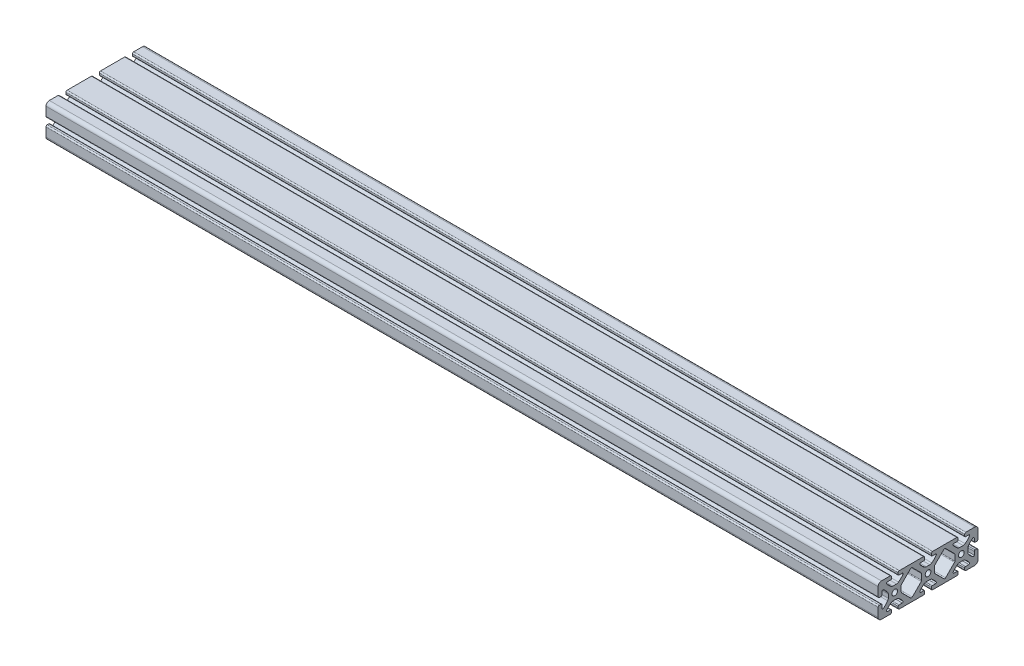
from build123d import *

# Parameters (mm, degrees)
MODEL_R                = 3.4
STRUKTURBAUTEIL1_DEPTH = 1000


with BuildPart() as part:
    # Model → Strukturbauteil1 (new body)
    with BuildSketch(Plane(origin=(0, 0, 0), x_dir=(0, 0, -1), z_dir=(1, 0, 0))):
        with BuildLine():
            Line((-60, 16), (-60, 5.5))
            ThreePointArc((-60, 5.5), (-59.560660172, 4.439339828), (-58.5, 4))
            Line((-58.5, 4), (-56.5, 4))
            ThreePointArc((-56.5, 4), (-55.792893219, 4.292893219), (-55.5, 5))
            Line((-55.5, 5), (-55.5, 8.963997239))
            ThreePointArc((-55.5, 8.963997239), (-54.931938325, 9.888298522), (-53.850713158, 9.798972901))
            ThreePointArc((-53.850713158, 9.798972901), (-50.99018775, 7.345508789), (-48.530952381, 4.489943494))
            ThreePointArc((-48.530952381, 4.489943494), (-47.950250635, 3.365314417), (-47.75, 2.115552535))
            Line((-47.75, 2.115552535), (-47.75, -2.115552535))
            ThreePointArc((-47.75, -2.115552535), (-47.950250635, -3.365314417), (-48.530952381, -4.489943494))
            ThreePointArc((-48.530952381, -4.489943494), (-50.99018775, -7.345508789), (-53.850713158, -9.798972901))
            ThreePointArc((-53.850713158, -9.798972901), (-54.931938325, -9.888298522), (-55.5, -8.963997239))
            Line((-55.5, -8.963997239), (-55.5, -5))
            ThreePointArc((-55.5, -5), (-55.792893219, -4.292893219), (-56.5, -4))
            Line((-56.5, -4), (-58.5, -4))
            ThreePointArc((-58.5, -4), (-59.560660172, -4.439339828), (-60, -5.5))
            Line((-60, -5.5), (-60, -16))
            ThreePointArc((-60, -16), (-58.828427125, -18.828427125), (-56, -20))
            Line((-56, -20), (-45.5, -20))
            ThreePointArc((-45.5, -20), (-44.439339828, -19.560660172), (-44, -18.5))
            Line((-44, -18.5), (-44, -16.5))
            ThreePointArc((-44, -16.5), (-44.292893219, -15.792893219), (-45, -15.5))
            Line((-45, -15.5), (-48.963997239, -15.5))
            ThreePointArc((-48.963997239, -15.5), (-49.888298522, -14.931938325), (-49.798972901, -13.850713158))
            ThreePointArc((-49.798972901, -13.850713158), (-47.345508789, -10.99018775), (-44.489943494, -8.530952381))
            ThreePointArc((-44.489943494, -8.530952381), (-43.365314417, -7.950250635), (-42.115552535, -7.75))
            Line((-42.115552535, -7.75), (-37.884447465, -7.75))
            ThreePointArc((-37.884447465, -7.75), (-36.634685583, -7.950250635), (-35.510056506, -8.530952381))
            ThreePointArc((-35.510056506, -8.530952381), (-32.654491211, -10.99018775), (-30.201027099, -13.850713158))
            ThreePointArc((-30.201027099, -13.850713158), (-30.111701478, -14.931938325), (-31.036002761, -15.5))
            Line((-31.036002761, -15.5), (-35, -15.5))
            ThreePointArc((-35, -15.5), (-35.707106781, -15.792893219), (-36, -16.5))
            Line((-36, -16.5), (-36, -18.5))
            ThreePointArc((-36, -18.5), (-35.560660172, -19.560660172), (-34.5, -20))
            Line((-34.5, -20), (-5.5, -20))
            ThreePointArc((-5.5, -20), (-4.439339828, -19.560660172), (-4, -18.5))
            Line((-4, -18.5), (-4, -16.5))
            ThreePointArc((-4, -16.5), (-4.292893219, -15.792893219), (-5, -15.5))
            Line((-5, -15.5), (-8.963997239, -15.5))
            ThreePointArc((-8.963997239, -15.5), (-9.888298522, -14.931938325), (-9.798972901, -13.850713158))
            ThreePointArc((-9.798972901, -13.850713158), (-7.345508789, -10.99018775), (-4.489943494, -8.530952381))
            ThreePointArc((-4.489943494, -8.530952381), (-3.365314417, -7.950250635), (-2.115552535, -7.75))
            Line((-2.115552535, -7.75), (2.115552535, -7.75))
            ThreePointArc((2.115552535, -7.75), (3.365314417, -7.950250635), (4.489943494, -8.530952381))
            ThreePointArc((4.489943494, -8.530952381), (7.345508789, -10.99018775), (9.798972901, -13.850713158))
            ThreePointArc((9.798972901, -13.850713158), (9.888298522, -14.931938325), (8.963997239, -15.5))
            Line((8.963997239, -15.5), (5, -15.5))
            ThreePointArc((5, -15.5), (4.292893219, -15.792893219), (4, -16.5))
            Line((4, -16.5), (4, -18.5))
            ThreePointArc((4, -18.5), (4.439339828, -19.560660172), (5.5, -20))
            Line((5.5, -20), (34.5, -20))
            ThreePointArc((34.5, -20), (35.560660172, -19.560660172), (36, -18.5))
            Line((36, -18.5), (36, -16.5))
            ThreePointArc((36, -16.5), (35.707106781, -15.792893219), (35, -15.5))
            Line((35, -15.5), (31.036002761, -15.5))
            ThreePointArc((31.036002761, -15.5), (30.111701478, -14.931938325), (30.201027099, -13.850713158))
            ThreePointArc((30.201027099, -13.850713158), (32.654491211, -10.99018775), (35.510056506, -8.530952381))
            ThreePointArc((35.510056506, -8.530952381), (36.634685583, -7.950250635), (37.884447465, -7.75))
            Line((37.884447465, -7.75), (42.115552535, -7.75))
            ThreePointArc((42.115552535, -7.75), (43.365314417, -7.950250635), (44.489943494, -8.530952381))
            ThreePointArc((44.489943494, -8.530952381), (47.345508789, -10.99018775), (49.798972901, -13.850713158))
            ThreePointArc((49.798972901, -13.850713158), (49.888298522, -14.931938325), (48.963997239, -15.5))
            Line((48.963997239, -15.5), (45, -15.5))
            ThreePointArc((45, -15.5), (44.292893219, -15.792893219), (44, -16.5))
            Line((44, -16.5), (44, -18.5))
            ThreePointArc((44, -18.5), (44.439339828, -19.560660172), (45.5, -20))
            Line((45.5, -20), (56, -20))
            ThreePointArc((56, -20), (58.828427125, -18.828427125), (60, -16))
            Line((60, -16), (60, -5.5))
            ThreePointArc((60, -5.5), (59.560660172, -4.439339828), (58.5, -4))
            Line((58.5, -4), (56.5, -4))
            ThreePointArc((56.5, -4), (55.792893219, -4.292893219), (55.5, -5))
            Line((55.5, -5), (55.5, -8.963997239))
            ThreePointArc((55.5, -8.963997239), (54.931938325, -9.888298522), (53.850713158, -9.798972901))
            ThreePointArc((53.850713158, -9.798972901), (50.99018775, -7.345508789), (48.530952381, -4.489943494))
            ThreePointArc((48.530952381, -4.489943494), (47.950250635, -3.365314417), (47.75, -2.115552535))
            Line((47.75, -2.115552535), (47.75, 2.115552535))
            ThreePointArc((47.75, 2.115552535), (47.950250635, 3.365314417), (48.530952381, 4.489943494))
            ThreePointArc((48.530952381, 4.489943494), (50.99018775, 7.345508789), (53.850713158, 9.798972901))
            ThreePointArc((53.850713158, 9.798972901), (54.931938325, 9.888298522), (55.5, 8.963997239))
            Line((55.5, 8.963997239), (55.5, 5))
            ThreePointArc((55.5, 5), (55.792893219, 4.292893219), (56.5, 4))
            Line((56.5, 4), (58.5, 4))
            ThreePointArc((58.5, 4), (59.560660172, 4.439339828), (60, 5.5))
            Line((60, 5.5), (60, 16))
            ThreePointArc((60, 16), (58.828427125, 18.828427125), (56, 20))
            Line((56, 20), (45.5, 20))
            ThreePointArc((45.5, 20), (44.439339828, 19.560660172), (44, 18.5))
            Line((44, 18.5), (44, 16.5))
            ThreePointArc((44, 16.5), (44.292893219, 15.792893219), (45, 15.5))
            Line((45, 15.5), (48.963997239, 15.5))
            ThreePointArc((48.963997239, 15.5), (49.888298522, 14.931938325), (49.798972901, 13.850713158))
            ThreePointArc((49.798972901, 13.850713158), (47.345508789, 10.99018775), (44.489943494, 8.530952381))
            ThreePointArc((44.489943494, 8.530952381), (43.365314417, 7.950250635), (42.115552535, 7.75))
            Line((42.115552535, 7.75), (37.884447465, 7.75))
            ThreePointArc((37.884447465, 7.75), (36.634685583, 7.950250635), (35.510056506, 8.530952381))
            ThreePointArc((35.510056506, 8.530952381), (32.654491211, 10.99018775), (30.201027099, 13.850713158))
            ThreePointArc((30.201027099, 13.850713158), (30.111701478, 14.931938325), (31.036002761, 15.5))
            Line((31.036002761, 15.5), (35, 15.5))
            ThreePointArc((35, 15.5), (35.707106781, 15.792893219), (36, 16.5))
            Line((36, 16.5), (36, 18.5))
            ThreePointArc((36, 18.5), (35.560660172, 19.560660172), (34.5, 20))
            Line((34.5, 20), (5.5, 20))
            ThreePointArc((5.5, 20), (4.439339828, 19.560660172), (4, 18.5))
            Line((4, 18.5), (4, 16.5))
            ThreePointArc((4, 16.5), (4.292893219, 15.792893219), (5, 15.5))
            Line((5, 15.5), (8.963997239, 15.5))
            ThreePointArc((8.963997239, 15.5), (9.888298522, 14.931938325), (9.798972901, 13.850713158))
            ThreePointArc((9.798972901, 13.850713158), (7.345508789, 10.99018775), (4.489943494, 8.530952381))
            ThreePointArc((4.489943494, 8.530952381), (3.365314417, 7.950250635), (2.115552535, 7.75))
            Line((2.115552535, 7.75), (-2.115552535, 7.75))
            ThreePointArc((-2.115552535, 7.75), (-3.365314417, 7.950250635), (-4.489943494, 8.530952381))
            ThreePointArc((-4.489943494, 8.530952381), (-7.345508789, 10.99018775), (-9.798972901, 13.850713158))
            ThreePointArc((-9.798972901, 13.850713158), (-9.888298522, 14.931938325), (-8.963997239, 15.5))
            Line((-8.963997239, 15.5), (-5, 15.5))
            ThreePointArc((-5, 15.5), (-4.292893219, 15.792893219), (-4, 16.5))
            Line((-4, 16.5), (-4, 18.5))
            ThreePointArc((-4, 18.5), (-4.439339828, 19.560660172), (-5.5, 20))
            Line((-5.5, 20), (-34.5, 20))
            ThreePointArc((-34.5, 20), (-35.560660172, 19.560660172), (-36, 18.5))
            Line((-36, 18.5), (-36, 16.5))
            ThreePointArc((-36, 16.5), (-35.707106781, 15.792893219), (-35, 15.5))
            Line((-35, 15.5), (-31.036002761, 15.5))
            ThreePointArc((-31.036002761, 15.5), (-30.111701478, 14.931938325), (-30.201027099, 13.850713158))
            ThreePointArc((-30.201027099, 13.850713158), (-32.654491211, 10.99018775), (-35.510056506, 8.530952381))
            ThreePointArc((-35.510056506, 8.530952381), (-36.634685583, 7.950250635), (-37.884447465, 7.75))
            Line((-37.884447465, 7.75), (-42.115552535, 7.75))
            ThreePointArc((-42.115552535, 7.75), (-43.365314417, 7.950250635), (-44.489943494, 8.530952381))
            ThreePointArc((-44.489943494, 8.530952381), (-47.345508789, 10.99018775), (-49.798972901, 13.850713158))
            ThreePointArc((-49.798972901, 13.850713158), (-49.888298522, 14.931938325), (-48.963997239, 15.5))
            Line((-48.963997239, 15.5), (-45, 15.5))
            ThreePointArc((-45, 15.5), (-44.292893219, 15.792893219), (-44, 16.5))
            Line((-44, 16.5), (-44, 18.5))
            ThreePointArc((-44, 18.5), (-44.439339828, 19.560660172), (-45.5, 20))
            Line((-45.5, 20), (-56, 20))
            ThreePointArc((-56, 20), (-58.828427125, 18.828427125), (-60, 16))
        make_face()
        with Locations((-40, 0)):
            Circle(MODEL_R, mode=Mode.SUBTRACT)
        Circle(MODEL_R, mode=Mode.SUBTRACT)
        with Locations((40, 0)):
            Circle(MODEL_R, mode=Mode.SUBTRACT)
        with BuildLine():
            Line((-32.25, 3.457106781), (-32.25, -3.457106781))
            ThreePointArc((-32.25, -3.457106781), (-32.135819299, -4.03113193), (-31.810660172, -4.517766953))
            Line((-31.810660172, -4.517766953), (-21.060660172, -15.267766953))
            ThreePointArc((-21.060660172, -15.267766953), (-20, -15.707106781), (-18.939339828, -15.267766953))
            Line((-18.939339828, -15.267766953), (-8.189339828, -4.517766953))
            ThreePointArc((-8.189339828, -4.517766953), (-7.864180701, -4.03113193), (-7.75, -3.457106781))
            Line((-7.75, -3.457106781), (-7.75, 3.457106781))
            ThreePointArc((-7.75, 3.457106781), (-7.864180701, 4.03113193), (-8.189339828, 4.517766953))
            Line((-8.189339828, 4.517766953), (-18.939339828, 15.267766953))
            ThreePointArc((-18.939339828, 15.267766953), (-20, 15.707106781), (-21.060660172, 15.267766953))
            Line((-21.060660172, 15.267766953), (-31.810660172, 4.517766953))
            ThreePointArc((-31.810660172, 4.517766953), (-32.135819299, 4.03113193), (-32.25, 3.457106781))
        make_face(mode=Mode.SUBTRACT)
        with BuildLine():
            Line((18.939339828, 15.267766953), (8.189339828, 4.517766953))
            ThreePointArc((8.189339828, 4.517766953), (7.864180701, 4.03113193), (7.75, 3.457106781))
            Line((7.75, 3.457106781), (7.75, -3.457106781))
            ThreePointArc((7.75, -3.457106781), (7.864180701, -4.03113193), (8.189339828, -4.517766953))
            Line((8.189339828, -4.517766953), (18.939339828, -15.267766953))
            ThreePointArc((18.939339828, -15.267766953), (20, -15.707106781), (21.060660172, -15.267766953))
            Line((21.060660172, -15.267766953), (31.810660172, -4.517766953))
            ThreePointArc((31.810660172, -4.517766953), (32.135819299, -4.03113193), (32.25, -3.457106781))
            Line((32.25, -3.457106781), (32.25, 3.457106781))
            ThreePointArc((32.25, 3.457106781), (32.135819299, 4.03113193), (31.810660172, 4.517766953))
            Line((31.810660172, 4.517766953), (21.060660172, 15.267766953))
            ThreePointArc((21.060660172, 15.267766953), (20, 15.707106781), (18.939339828, 15.267766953))
        make_face(mode=Mode.SUBTRACT)
    extrude(amount=STRUKTURBAUTEIL1_DEPTH)


solid = part.part
